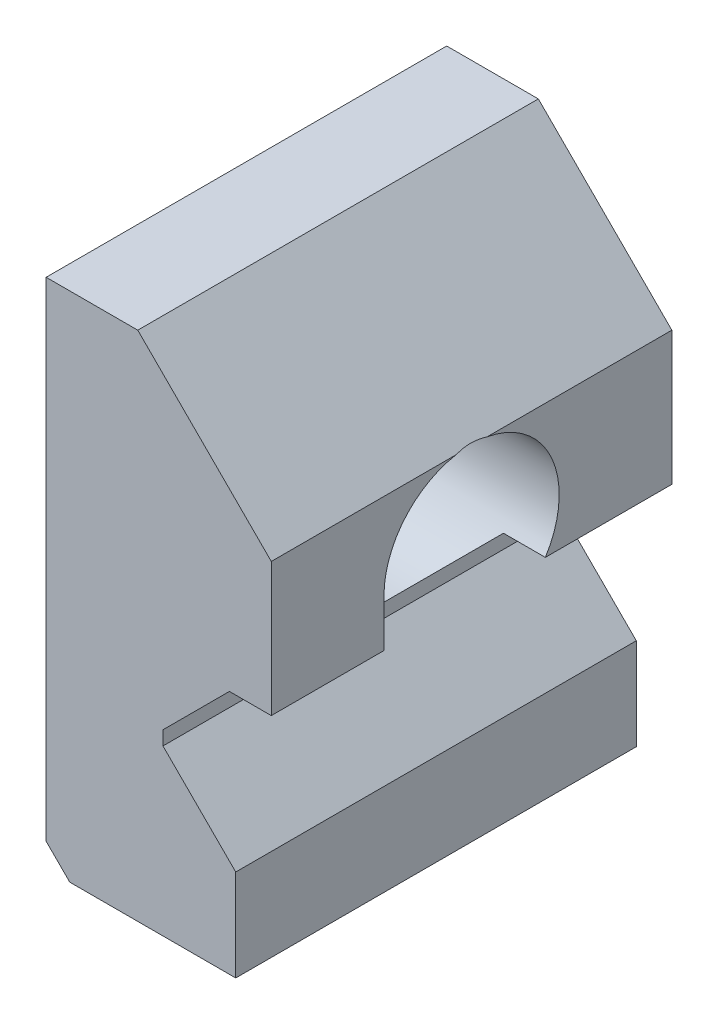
ISO-10303-21;
HEADER;
FILE_DESCRIPTION(('STEP AP214'),'2;1');
FILE_NAME('part.step','',(''),(''),'','','');
FILE_SCHEMA(('AUTOMOTIVE_DESIGN { 1 0 10303 214 1 1 1 1 }'));
ENDSEC;
DATA;
#1=APPLICATION_CONTEXT('core data for automotive mechanical design processes');
#2=APPLICATION_PROTOCOL_DEFINITION('international standard','automotive_design',2000,#1);
#3=PRODUCT_CONTEXT('',#1,'mechanical');
#4=PRODUCT('Part','Part','',(#3));
#5=PRODUCT_RELATED_PRODUCT_CATEGORY('part','',(#4));
#6=PRODUCT_DEFINITION_FORMATION('','',#4);
#7=PRODUCT_DEFINITION_CONTEXT('part definition',#1,'design');
#8=PRODUCT_DEFINITION('design','',#6,#7);
#9=PRODUCT_DEFINITION_SHAPE('','',#8);
#10=(LENGTH_UNIT() NAMED_UNIT(*) SI_UNIT(.MILLI.,.METRE.));
#11=(NAMED_UNIT(*) PLANE_ANGLE_UNIT() SI_UNIT($,.RADIAN.));
#12=(NAMED_UNIT(*) SI_UNIT($,.STERADIAN.) SOLID_ANGLE_UNIT());
#13=UNCERTAINTY_MEASURE_WITH_UNIT(LENGTH_MEASURE(1.E-05),#10,'distance_accuracy_value','');
#14=(GEOMETRIC_REPRESENTATION_CONTEXT(3) GLOBAL_UNCERTAINTY_ASSIGNED_CONTEXT((#13)) GLOBAL_UNIT_ASSIGNED_CONTEXT((#10,
#11,#12)) REPRESENTATION_CONTEXT('',''));
#15=CARTESIAN_POINT('',(0.,0.,0.));
#16=DIRECTION('',(0.,0.,1.));
#17=DIRECTION('',(1.,0.,0.));
#18=AXIS2_PLACEMENT_3D('',#15,#16,#17);
#19=CARTESIAN_POINT('',(-11.2395,4.59292261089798,7.62));
#20=DIRECTION('',(-1.,0.,0.));
#21=DIRECTION('',(0.,-1.,0.));
#22=AXIS2_PLACEMENT_3D('',#19,#20,#21);
#23=CYLINDRICAL_SURFACE('',#22,3.33375);
#24=CARTESIAN_POINT('',(-22.6695,4.59292261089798,7.62));
#25=DIRECTION('',(-1.,0.,0.));
#26=DIRECTION('',(0.,-1.,0.));
#27=AXIS2_PLACEMENT_3D('',#24,#25,#26);
#28=CIRCLE('',#27,3.33375);
#29=CARTESIAN_POINT('',(-22.6695,1.25917261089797,7.62));
#30=VERTEX_POINT('',#29);
#31=EDGE_CURVE('E65',#30,#30,#28,.F.);
#32=ORIENTED_EDGE('',*,*,#31,.F.);
#33=EDGE_LOOP('',(#32));
#34=FACE_BOUND('',#33,.T.);
#35=DIRECTION('',(1.,0.,0.));
#36=VECTOR('',#35,1.);
#37=CARTESIAN_POINT('',(-16.9672,4.59292261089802,10.95375));
#38=LINE('',#37,#36);
#39=CARTESIAN_POINT('',(-16.9672,4.59292261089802,10.95375));
#40=VERTEX_POINT('',#39);
#41=CARTESIAN_POINT('',(-15.37335,4.59292261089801,10.95375));
#42=VERTEX_POINT('',#41);
#43=EDGE_CURVE('E172',#40,#42,#38,.T.);
#44=ORIENTED_EDGE('',*,*,#43,.F.);
#45=CARTESIAN_POINT('',(-16.9672,4.59292261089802,7.62));
#46=DIRECTION('',(-1.,0.,0.));
#47=DIRECTION('',(0.,-1.,0.));
#48=AXIS2_PLACEMENT_3D('',#45,#46,#47);
#49=CIRCLE('',#48,3.33375);
#50=CARTESIAN_POINT('',(-16.9672,2.79400000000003,10.4267359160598));
#51=VERTEX_POINT('',#50);
#52=EDGE_CURVE('E179',#51,#40,#49,.T.);
#53=ORIENTED_EDGE('',*,*,#52,.F.);
#54=CARTESIAN_POINT('',(-15.168277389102,4.59292261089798,7.62));
#55=DIRECTION('',(-0.707106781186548,0.707106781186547,0.));
#56=DIRECTION('',(-0.707106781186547,-0.707106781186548,0.));
#57=AXIS2_PLACEMENT_3D('',#54,#55,#56);
#58=ELLIPSE('',#57,4.7146344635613,3.33375);
#59=CARTESIAN_POINT('',(-16.9672,2.79399999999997,4.81326408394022));
#60=VERTEX_POINT('',#59);
#61=EDGE_CURVE('E207',#60,#51,#58,.T.);
#62=ORIENTED_EDGE('',*,*,#61,.F.);
#63=DIRECTION('',(-1.,0.,0.));
#64=VECTOR('',#63,1.);
#65=CARTESIAN_POINT('',(-11.2395,2.79399999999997,4.81326408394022));
#66=LINE('',#65,#64);
#67=CARTESIAN_POINT('',(-15.37335,2.79399999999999,4.81326408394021));
#68=VERTEX_POINT('',#67);
#69=EDGE_CURVE('E86',#68,#60,#66,.T.);
#70=ORIENTED_EDGE('',*,*,#69,.F.);
#71=CARTESIAN_POINT('',(-15.37335,4.59292261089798,7.62));
#72=DIRECTION('',(-1.,0.,0.));
#73=DIRECTION('',(0.,-1.,0.));
#74=AXIS2_PLACEMENT_3D('',#71,#72,#73);
#75=CIRCLE('',#74,3.33375);
#76=CARTESIAN_POINT('',(-15.37335,7.874,7.0297286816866));
#77=VERTEX_POINT('',#76);
#78=EDGE_CURVE('E71',#77,#68,#75,.T.);
#79=ORIENTED_EDGE('',*,*,#78,.F.);
#80=CARTESIAN_POINT('',(-12.092272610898,4.59292261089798,7.62));
#81=DIRECTION('',(-0.707106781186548,-0.707106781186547,0.));
#82=DIRECTION('',(-0.707106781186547,0.707106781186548,0.));
#83=AXIS2_PLACEMENT_3D('',#80,#81,#82);
#84=ELLIPSE('',#83,4.71463446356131,3.33375);
#85=CARTESIAN_POINT('',(-15.37335,7.874,8.21027131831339));
#86=VERTEX_POINT('',#85);
#87=EDGE_CURVE('E210',#86,#77,#84,.T.);
#88=ORIENTED_EDGE('',*,*,#87,.F.);
#89=EDGE_CURVE('E12',#42,#86,#75,.T.);
#90=ORIENTED_EDGE('',*,*,#89,.F.);
#91=EDGE_LOOP('',(#44,#53,#62,#70,#79,#88,#90));
#92=FACE_BOUND('',#91,.T.);
#93=ADVANCED_FACE('F61',(#34,#92),#23,.F.);
#94=CARTESIAN_POINT('',(-16.9672,2.794,15.24));
#95=DIRECTION('',(0.,1.,0.));
#96=DIRECTION('',(-1.,0.,0.));
#97=AXIS2_PLACEMENT_3D('',#94,#95,#96);
#98=PLANE('',#97);
#99=DIRECTION('',(0.,0.,-1.));
#100=VECTOR('',#99,1.);
#101=CARTESIAN_POINT('',(-15.37335,2.79399999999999,15.24));
#102=LINE('',#101,#100);
#103=CARTESIAN_POINT('',(-15.37335,2.79399999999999,0.));
#104=VERTEX_POINT('',#103);
#105=EDGE_CURVE('E290',#68,#104,#102,.T.);
#106=ORIENTED_EDGE('',*,*,#105,.F.);
#107=ORIENTED_EDGE('',*,*,#69,.T.);
#108=DIRECTION('',(0.,0.,-1.));
#109=VECTOR('',#108,1.);
#110=CARTESIAN_POINT('',(-16.9672,2.794,15.24));
#111=LINE('',#110,#109);
#112=CARTESIAN_POINT('',(-16.9672,2.794,0.));
#113=VERTEX_POINT('',#112);
#114=EDGE_CURVE('E295',#60,#113,#111,.T.);
#115=ORIENTED_EDGE('',*,*,#114,.T.);
#116=DIRECTION('',(1.,0.,0.));
#117=VECTOR('',#116,1.);
#118=CARTESIAN_POINT('',(-16.9672,2.794,0.));
#119=LINE('',#118,#117);
#120=EDGE_CURVE('E279',#113,#104,#119,.T.);
#121=ORIENTED_EDGE('',*,*,#120,.T.);
#122=EDGE_LOOP('',(#106,#107,#115,#121));
#123=FACE_BOUND('',#122,.T.);
#124=ADVANCED_FACE('F337',(#123),#98,.F.);
#125=CARTESIAN_POINT('',(-15.37335,2.79399999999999,15.24));
#126=DIRECTION('',(-1.,0.,0.));
#127=DIRECTION('',(0.,-1.,0.));
#128=AXIS2_PLACEMENT_3D('',#125,#126,#127);
#129=PLANE('',#128);
#130=CARTESIAN_POINT('',(-15.37335,2.79399999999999,15.24));
#131=VERTEX_POINT('',#130);
#132=CARTESIAN_POINT('',(-15.37335,2.79400000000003,10.95375));
#133=VERTEX_POINT('',#132);
#134=EDGE_CURVE('E291',#131,#133,#102,.T.);
#135=ORIENTED_EDGE('',*,*,#134,.T.);
#136=DIRECTION('',(0.,-1.,0.));
#137=VECTOR('',#136,1.);
#138=CARTESIAN_POINT('',(-15.37335,4.59292261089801,10.95375));
#139=LINE('',#138,#137);
#140=EDGE_CURVE('E185',#42,#133,#139,.T.);
#141=ORIENTED_EDGE('',*,*,#140,.F.);
#142=ORIENTED_EDGE('',*,*,#89,.T.);
#143=DIRECTION('',(0.,0.,-1.));
#144=VECTOR('',#143,1.);
#145=CARTESIAN_POINT('',(-15.37335,7.874,15.24));
#146=LINE('',#145,#144);
#147=CARTESIAN_POINT('',(-15.37335,7.874,15.24));
#148=VERTEX_POINT('',#147);
#149=EDGE_CURVE('E286',#148,#86,#146,.T.);
#150=ORIENTED_EDGE('',*,*,#149,.F.);
#151=DIRECTION('',(0.,1.,0.));
#152=VECTOR('',#151,1.);
#153=CARTESIAN_POINT('',(-15.37335,2.79399999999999,15.24));
#154=LINE('',#153,#152);
#155=EDGE_CURVE('E247',#131,#148,#154,.T.);
#156=ORIENTED_EDGE('',*,*,#155,.F.);
#157=EDGE_LOOP('',(#135,#141,#142,#150,#156));
#158=FACE_BOUND('',#157,.T.);
#159=ADVANCED_FACE('F355',(#158),#129,.F.);
#160=CARTESIAN_POINT('',(-15.37335,7.874,15.24));
#161=DIRECTION('',(-0.707106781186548,-0.707106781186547,0.));
#162=DIRECTION('',(0.707106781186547,-0.707106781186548,0.));
#163=AXIS2_PLACEMENT_3D('',#160,#161,#162);
#164=PLANE('',#163);
#165=ORIENTED_EDGE('',*,*,#149,.T.);
#166=ORIENTED_EDGE('',*,*,#87,.T.);
#167=CARTESIAN_POINT('',(-15.37335,7.874,0.));
#168=VERTEX_POINT('',#167);
#169=EDGE_CURVE('E250',#77,#168,#146,.T.);
#170=ORIENTED_EDGE('',*,*,#169,.T.);
#171=DIRECTION('',(-0.707106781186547,0.707106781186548,0.));
#172=VECTOR('',#171,1.);
#173=CARTESIAN_POINT('',(-15.37335,7.874,0.));
#174=LINE('',#173,#172);
#175=CARTESIAN_POINT('',(-20.45335,12.954,0.));
#176=VERTEX_POINT('',#175);
#177=EDGE_CURVE('E214',#168,#176,#174,.T.);
#178=ORIENTED_EDGE('',*,*,#177,.T.);
#179=DIRECTION('',(0.,0.,-1.));
#180=VECTOR('',#179,1.);
#181=CARTESIAN_POINT('',(-20.45335,12.954,15.24));
#182=LINE('',#181,#180);
#183=CARTESIAN_POINT('',(-20.45335,12.954,15.24));
#184=VERTEX_POINT('',#183);
#185=EDGE_CURVE('E328',#184,#176,#182,.T.);
#186=ORIENTED_EDGE('',*,*,#185,.F.);
#187=DIRECTION('',(-0.707106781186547,0.707106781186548,0.));
#188=VECTOR('',#187,1.);
#189=CARTESIAN_POINT('',(-15.37335,7.874,15.24));
#190=LINE('',#189,#188);
#191=EDGE_CURVE('E215',#148,#184,#190,.T.);
#192=ORIENTED_EDGE('',*,*,#191,.F.);
#193=EDGE_LOOP('',(#165,#166,#170,#178,#186,#192));
#194=FACE_BOUND('',#193,.T.);
#195=ADVANCED_FACE('F63',(#194),#164,.F.);
#196=CARTESIAN_POINT('',(-20.45335,12.954,15.24));
#197=DIRECTION('',(0.,-1.,0.));
#198=DIRECTION('',(1.,0.,0.));
#199=AXIS2_PLACEMENT_3D('',#196,#197,#198);
#200=PLANE('',#199);
#201=DIRECTION('',(-1.,0.,0.));
#202=VECTOR('',#201,1.);
#203=CARTESIAN_POINT('',(-20.45335,12.954,0.));
#204=LINE('',#203,#202);
#205=CARTESIAN_POINT('',(-23.9395,12.954,0.));
#206=VERTEX_POINT('',#205);
#207=EDGE_CURVE('E254',#176,#206,#204,.T.);
#208=ORIENTED_EDGE('',*,*,#207,.T.);
#209=DIRECTION('',(0.,0.,-1.));
#210=VECTOR('',#209,1.);
#211=CARTESIAN_POINT('',(-23.9395,12.954,15.24));
#212=LINE('',#211,#210);
#213=CARTESIAN_POINT('',(-23.9395,12.954,15.24));
#214=VERTEX_POINT('',#213);
#215=EDGE_CURVE('E324',#214,#206,#212,.T.);
#216=ORIENTED_EDGE('',*,*,#215,.F.);
#217=DIRECTION('',(-1.,0.,0.));
#218=VECTOR('',#217,1.);
#219=CARTESIAN_POINT('',(-20.45335,12.954,15.24));
#220=LINE('',#219,#218);
#221=EDGE_CURVE('E219',#184,#214,#220,.T.);
#222=ORIENTED_EDGE('',*,*,#221,.F.);
#223=ORIENTED_EDGE('',*,*,#185,.T.);
#224=EDGE_LOOP('',(#208,#216,#222,#223));
#225=FACE_BOUND('',#224,.T.);
#226=ADVANCED_FACE('F400',(#225),#200,.F.);
#227=CARTESIAN_POINT('',(-23.9395,12.954,15.24));
#228=DIRECTION('',(1.,0.,0.));
#229=DIRECTION('',(0.,0.,-1.));
#230=AXIS2_PLACEMENT_3D('',#227,#228,#229);
#231=PLANE('',#230);
#232=CARTESIAN_POINT('',(-23.9395,4.59292261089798,7.62));
#233=DIRECTION('',(-1.,0.,0.));
#234=DIRECTION('',(0.,-1.,0.));
#235=AXIS2_PLACEMENT_3D('',#232,#233,#234);
#236=CIRCLE('',#235,6.50875);
#237=CARTESIAN_POINT('',(-23.9395,-1.91582738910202,7.62));
#238=VERTEX_POINT('',#237);
#239=EDGE_CURVE('E193',#238,#238,#236,.T.);
#240=ORIENTED_EDGE('',*,*,#239,.F.);
#241=EDGE_LOOP('',(#240));
#242=FACE_BOUND('',#241,.T.);
#243=DIRECTION('',(0.,-1.,0.));
#244=VECTOR('',#243,1.);
#245=CARTESIAN_POINT('',(-23.9395,12.954,0.));
#246=LINE('',#245,#244);
#247=CARTESIAN_POINT('',(-23.9395,-5.62977438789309,0.));
#248=VERTEX_POINT('',#247);
#249=EDGE_CURVE('E257',#206,#248,#246,.T.);
#250=ORIENTED_EDGE('',*,*,#249,.T.);
#251=DIRECTION('',(0.,0.,-1.));
#252=VECTOR('',#251,1.);
#253=CARTESIAN_POINT('',(-23.9395,-5.62977438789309,15.24));
#254=LINE('',#253,#252);
#255=CARTESIAN_POINT('',(-23.9395,-5.62977438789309,15.24));
#256=VERTEX_POINT('',#255);
#257=EDGE_CURVE('E320',#256,#248,#254,.T.);
#258=ORIENTED_EDGE('',*,*,#257,.F.);
#259=DIRECTION('',(0.,-1.,0.));
#260=VECTOR('',#259,1.);
#261=CARTESIAN_POINT('',(-23.9395,12.954,15.24));
#262=LINE('',#261,#260);
#263=EDGE_CURVE('E223',#214,#256,#262,.T.);
#264=ORIENTED_EDGE('',*,*,#263,.F.);
#265=ORIENTED_EDGE('',*,*,#215,.T.);
#266=EDGE_LOOP('',(#250,#258,#264,#265));
#267=FACE_BOUND('',#266,.T.);
#268=ADVANCED_FACE('F397',(#242,#267),#231,.F.);
#269=CARTESIAN_POINT('',(-23.9395,-5.62977438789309,15.24));
#270=DIRECTION('',(0.707106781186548,0.707106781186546,0.));
#271=DIRECTION('',(-0.707106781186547,0.707106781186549,0.));
#272=AXIS2_PLACEMENT_3D('',#269,#270,#271);
#273=PLANE('',#272);
#274=DIRECTION('',(0.707106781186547,-0.707106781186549,0.));
#275=VECTOR('',#274,1.);
#276=CARTESIAN_POINT('',(-23.9395,-5.62977438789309,0.));
#277=LINE('',#276,#275);
#278=CARTESIAN_POINT('',(-23.0414743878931,-6.52780000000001,0.));
#279=VERTEX_POINT('',#278);
#280=EDGE_CURVE('E260',#248,#279,#277,.T.);
#281=ORIENTED_EDGE('',*,*,#280,.T.);
#282=DIRECTION('',(0.,0.,-1.));
#283=VECTOR('',#282,1.);
#284=CARTESIAN_POINT('',(-23.0414743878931,-6.52780000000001,15.24));
#285=LINE('',#284,#283);
#286=CARTESIAN_POINT('',(-23.0414743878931,-6.52780000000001,15.24));
#287=VERTEX_POINT('',#286);
#288=EDGE_CURVE('E316',#287,#279,#285,.T.);
#289=ORIENTED_EDGE('',*,*,#288,.F.);
#290=DIRECTION('',(0.707106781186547,-0.707106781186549,0.));
#291=VECTOR('',#290,1.);
#292=CARTESIAN_POINT('',(-23.9395,-5.62977438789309,15.24));
#293=LINE('',#292,#291);
#294=EDGE_CURVE('E226',#256,#287,#293,.T.);
#295=ORIENTED_EDGE('',*,*,#294,.F.);
#296=ORIENTED_EDGE('',*,*,#257,.T.);
#297=EDGE_LOOP('',(#281,#289,#295,#296));
#298=FACE_BOUND('',#297,.T.);
#299=ADVANCED_FACE('F393',(#298),#273,.F.);
#300=CARTESIAN_POINT('',(-23.0414743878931,-6.52780000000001,15.24));
#301=DIRECTION('',(0.,1.,0.));
#302=DIRECTION('',(-1.,0.,0.));
#303=AXIS2_PLACEMENT_3D('',#300,#301,#302);
#304=PLANE('',#303);
#305=DIRECTION('',(1.,0.,0.));
#306=VECTOR('',#305,1.);
#307=CARTESIAN_POINT('',(-23.0414743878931,-6.52780000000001,0.));
#308=LINE('',#307,#306);
#309=CARTESIAN_POINT('',(-16.7259,-6.52780000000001,0.));
#310=VERTEX_POINT('',#309);
#311=EDGE_CURVE('E263',#279,#310,#308,.T.);
#312=ORIENTED_EDGE('',*,*,#311,.T.);
#313=DIRECTION('',(0.,0.,-1.));
#314=VECTOR('',#313,1.);
#315=CARTESIAN_POINT('',(-16.7259,-6.52780000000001,15.24));
#316=LINE('',#315,#314);
#317=CARTESIAN_POINT('',(-16.7259,-6.52780000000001,15.24));
#318=VERTEX_POINT('',#317);
#319=EDGE_CURVE('E312',#318,#310,#316,.T.);
#320=ORIENTED_EDGE('',*,*,#319,.F.);
#321=DIRECTION('',(1.,0.,0.));
#322=VECTOR('',#321,1.);
#323=CARTESIAN_POINT('',(-23.0414743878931,-6.52780000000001,15.24));
#324=LINE('',#323,#322);
#325=EDGE_CURVE('E229',#287,#318,#324,.T.);
#326=ORIENTED_EDGE('',*,*,#325,.F.);
#327=ORIENTED_EDGE('',*,*,#288,.T.);
#328=EDGE_LOOP('',(#312,#320,#326,#327));
#329=FACE_BOUND('',#328,.T.);
#330=ADVANCED_FACE('F389',(#329),#304,.F.);
#331=CARTESIAN_POINT('',(-16.7259,-6.52780000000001,15.24));
#332=DIRECTION('',(-1.,0.,0.));
#333=DIRECTION('',(0.,0.,1.));
#334=AXIS2_PLACEMENT_3D('',#331,#332,#333);
#335=PLANE('',#334);
#336=DIRECTION('',(0.,1.,0.));
#337=VECTOR('',#336,1.);
#338=CARTESIAN_POINT('',(-16.7259,-6.52780000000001,0.));
#339=LINE('',#338,#337);
#340=CARTESIAN_POINT('',(-16.7259,-3.03530000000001,0.));
#341=VERTEX_POINT('',#340);
#342=EDGE_CURVE('E266',#310,#341,#339,.T.);
#343=ORIENTED_EDGE('',*,*,#342,.T.);
#344=DIRECTION('',(0.,0.,-1.));
#345=VECTOR('',#344,1.);
#346=CARTESIAN_POINT('',(-16.7259,-3.03530000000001,15.24));
#347=LINE('',#346,#345);
#348=CARTESIAN_POINT('',(-16.7259,-3.03530000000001,15.24));
#349=VERTEX_POINT('',#348);
#350=EDGE_CURVE('E308',#349,#341,#347,.T.);
#351=ORIENTED_EDGE('',*,*,#350,.F.);
#352=DIRECTION('',(0.,1.,0.));
#353=VECTOR('',#352,1.);
#354=CARTESIAN_POINT('',(-16.7259,-6.52780000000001,15.24));
#355=LINE('',#354,#353);
#356=EDGE_CURVE('E232',#318,#349,#355,.T.);
#357=ORIENTED_EDGE('',*,*,#356,.F.);
#358=ORIENTED_EDGE('',*,*,#319,.T.);
#359=EDGE_LOOP('',(#343,#351,#357,#358));
#360=FACE_BOUND('',#359,.T.);
#361=ADVANCED_FACE('F385',(#360),#335,.F.);
#362=CARTESIAN_POINT('',(-16.7259,-3.03530000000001,15.24));
#363=DIRECTION('',(-0.707106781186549,-0.707106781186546,0.));
#364=DIRECTION('',(0.707106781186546,-0.707106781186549,0.));
#365=AXIS2_PLACEMENT_3D('',#362,#363,#364);
#366=PLANE('',#365);
#367=DIRECTION('',(-0.707106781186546,0.707106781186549,0.));
#368=VECTOR('',#367,1.);
#369=CARTESIAN_POINT('',(-16.7259,-3.03530000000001,0.));
#370=LINE('',#369,#368);
#371=CARTESIAN_POINT('',(-19.4945,-0.266700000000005,0.));
#372=VERTEX_POINT('',#371);
#373=EDGE_CURVE('E269',#341,#372,#370,.T.);
#374=ORIENTED_EDGE('',*,*,#373,.T.);
#375=DIRECTION('',(0.,0.,-1.));
#376=VECTOR('',#375,1.);
#377=CARTESIAN_POINT('',(-19.4945,-0.266700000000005,15.24));
#378=LINE('',#377,#376);
#379=CARTESIAN_POINT('',(-19.4945,-0.266700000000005,15.24));
#380=VERTEX_POINT('',#379);
#381=EDGE_CURVE('E304',#380,#372,#378,.T.);
#382=ORIENTED_EDGE('',*,*,#381,.F.);
#383=DIRECTION('',(-0.707106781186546,0.707106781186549,0.));
#384=VECTOR('',#383,1.);
#385=CARTESIAN_POINT('',(-16.7259,-3.03530000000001,15.24));
#386=LINE('',#385,#384);
#387=EDGE_CURVE('E235',#349,#380,#386,.T.);
#388=ORIENTED_EDGE('',*,*,#387,.F.);
#389=ORIENTED_EDGE('',*,*,#350,.T.);
#390=EDGE_LOOP('',(#374,#382,#388,#389));
#391=FACE_BOUND('',#390,.T.);
#392=ADVANCED_FACE('F381',(#391),#366,.F.);
#393=CARTESIAN_POINT('',(-19.4945,-0.266700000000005,15.24));
#394=DIRECTION('',(-1.,0.,0.));
#395=DIRECTION('',(0.,-1.,0.));
#396=AXIS2_PLACEMENT_3D('',#393,#394,#395);
#397=PLANE('',#396);
#398=DIRECTION('',(0.,1.,0.));
#399=VECTOR('',#398,1.);
#400=CARTESIAN_POINT('',(-19.4945,-0.266700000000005,0.));
#401=LINE('',#400,#399);
#402=CARTESIAN_POINT('',(-19.4945,0.26669999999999,0.));
#403=VERTEX_POINT('',#402);
#404=EDGE_CURVE('E272',#372,#403,#401,.T.);
#405=ORIENTED_EDGE('',*,*,#404,.T.);
#406=DIRECTION('',(0.,0.,-1.));
#407=VECTOR('',#406,1.);
#408=CARTESIAN_POINT('',(-19.4945,0.26669999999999,15.24));
#409=LINE('',#408,#407);
#410=CARTESIAN_POINT('',(-19.4945,0.26669999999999,15.24));
#411=VERTEX_POINT('',#410);
#412=EDGE_CURVE('E300',#411,#403,#409,.T.);
#413=ORIENTED_EDGE('',*,*,#412,.F.);
#414=DIRECTION('',(0.,1.,0.));
#415=VECTOR('',#414,1.);
#416=CARTESIAN_POINT('',(-19.4945,-0.266700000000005,15.24));
#417=LINE('',#416,#415);
#418=EDGE_CURVE('E238',#380,#411,#417,.T.);
#419=ORIENTED_EDGE('',*,*,#418,.F.);
#420=ORIENTED_EDGE('',*,*,#381,.T.);
#421=EDGE_LOOP('',(#405,#413,#419,#420));
#422=FACE_BOUND('',#421,.T.);
#423=ADVANCED_FACE('F377',(#422),#397,.F.);
#424=CARTESIAN_POINT('',(-19.4945,0.26669999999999,15.24));
#425=DIRECTION('',(-0.707106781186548,0.707106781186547,0.));
#426=DIRECTION('',(-0.707106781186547,-0.707106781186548,0.));
#427=AXIS2_PLACEMENT_3D('',#424,#425,#426);
#428=PLANE('',#427);
#429=ORIENTED_EDGE('',*,*,#114,.F.);
#430=ORIENTED_EDGE('',*,*,#61,.T.);
#431=DIRECTION('',(0.,0.,-1.));
#432=VECTOR('',#431,1.);
#433=CARTESIAN_POINT('',(-16.9672,2.79400000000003,10.95375));
#434=LINE('',#433,#432);
#435=CARTESIAN_POINT('',(-16.9672,2.794,10.95375));
#436=VERTEX_POINT('',#435);
#437=EDGE_CURVE('E178',#436,#51,#434,.T.);
#438=ORIENTED_EDGE('',*,*,#437,.F.);
#439=CARTESIAN_POINT('',(-16.9672,2.794,15.24));
#440=VERTEX_POINT('',#439);
#441=EDGE_CURVE('E296',#440,#436,#111,.T.);
#442=ORIENTED_EDGE('',*,*,#441,.F.);
#443=DIRECTION('',(0.707106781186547,0.707106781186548,0.));
#444=VECTOR('',#443,1.);
#445=CARTESIAN_POINT('',(-19.4945,0.26669999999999,15.24));
#446=LINE('',#445,#444);
#447=EDGE_CURVE('E241',#411,#440,#446,.T.);
#448=ORIENTED_EDGE('',*,*,#447,.F.);
#449=ORIENTED_EDGE('',*,*,#412,.T.);
#450=DIRECTION('',(0.707106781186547,0.707106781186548,0.));
#451=VECTOR('',#450,1.);
#452=CARTESIAN_POINT('',(-19.4945,0.26669999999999,0.));
#453=LINE('',#452,#451);
#454=EDGE_CURVE('E275',#403,#113,#453,.T.);
#455=ORIENTED_EDGE('',*,*,#454,.T.);
#456=EDGE_LOOP('',(#429,#430,#438,#442,#448,#449,#455));
#457=FACE_BOUND('',#456,.T.);
#458=ADVANCED_FACE('F373',(#457),#428,.F.);
#459=ORIENTED_EDGE('',*,*,#441,.T.);
#460=DIRECTION('',(1.,0.,0.));
#461=VECTOR('',#460,1.);
#462=CARTESIAN_POINT('',(-16.9672,2.79400000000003,10.95375));
#463=LINE('',#462,#461);
#464=EDGE_CURVE('E175',#436,#133,#463,.T.);
#465=ORIENTED_EDGE('',*,*,#464,.T.);
#466=ORIENTED_EDGE('',*,*,#134,.F.);
#467=DIRECTION('',(1.,0.,0.));
#468=VECTOR('',#467,1.);
#469=CARTESIAN_POINT('',(-16.9672,2.794,15.24));
#470=LINE('',#469,#468);
#471=EDGE_CURVE('E244',#440,#131,#470,.T.);
#472=ORIENTED_EDGE('',*,*,#471,.F.);
#473=EDGE_LOOP('',(#459,#465,#466,#472));
#474=FACE_BOUND('',#473,.T.);
#475=ADVANCED_FACE('F357',(#474),#98,.F.);
#476=ORIENTED_EDGE('',*,*,#169,.F.);
#477=ORIENTED_EDGE('',*,*,#78,.T.);
#478=ORIENTED_EDGE('',*,*,#105,.T.);
#479=DIRECTION('',(0.,1.,0.));
#480=VECTOR('',#479,1.);
#481=CARTESIAN_POINT('',(-15.37335,2.79399999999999,0.));
#482=LINE('',#481,#480);
#483=EDGE_CURVE('E220',#104,#168,#482,.T.);
#484=ORIENTED_EDGE('',*,*,#483,.T.);
#485=EDGE_LOOP('',(#476,#477,#478,#484));
#486=FACE_BOUND('',#485,.T.);
#487=ADVANCED_FACE('F335',(#486),#129,.F.);
#488=CARTESIAN_POINT('',(0.,0.,15.24));
#489=DIRECTION('',(0.,0.,-1.));
#490=DIRECTION('',(-1.,0.,0.));
#491=AXIS2_PLACEMENT_3D('',#488,#489,#490);
#492=PLANE('',#491);
#493=ORIENTED_EDGE('',*,*,#191,.T.);
#494=ORIENTED_EDGE('',*,*,#221,.T.);
#495=ORIENTED_EDGE('',*,*,#263,.T.);
#496=ORIENTED_EDGE('',*,*,#294,.T.);
#497=ORIENTED_EDGE('',*,*,#325,.T.);
#498=ORIENTED_EDGE('',*,*,#356,.T.);
#499=ORIENTED_EDGE('',*,*,#387,.T.);
#500=ORIENTED_EDGE('',*,*,#418,.T.);
#501=ORIENTED_EDGE('',*,*,#447,.T.);
#502=ORIENTED_EDGE('',*,*,#471,.T.);
#503=ORIENTED_EDGE('',*,*,#155,.T.);
#504=EDGE_LOOP('',(#493,#494,#495,#496,#497,#498,#499,#500,#501,#502,#503));
#505=FACE_BOUND('',#504,.T.);
#506=ADVANCED_FACE('F362',(#505),#492,.F.);
#507=CARTESIAN_POINT('',(0.,0.,0.));
#508=DIRECTION('',(0.,0.,-1.));
#509=DIRECTION('',(-1.,0.,0.));
#510=AXIS2_PLACEMENT_3D('',#507,#508,#509);
#511=PLANE('',#510);
#512=ORIENTED_EDGE('',*,*,#177,.F.);
#513=ORIENTED_EDGE('',*,*,#483,.F.);
#514=ORIENTED_EDGE('',*,*,#120,.F.);
#515=ORIENTED_EDGE('',*,*,#454,.F.);
#516=ORIENTED_EDGE('',*,*,#404,.F.);
#517=ORIENTED_EDGE('',*,*,#373,.F.);
#518=ORIENTED_EDGE('',*,*,#342,.F.);
#519=ORIENTED_EDGE('',*,*,#311,.F.);
#520=ORIENTED_EDGE('',*,*,#280,.F.);
#521=ORIENTED_EDGE('',*,*,#249,.F.);
#522=ORIENTED_EDGE('',*,*,#207,.F.);
#523=EDGE_LOOP('',(#512,#513,#514,#515,#516,#517,#518,#519,#520,#521,#522));
#524=FACE_BOUND('',#523,.T.);
#525=ADVANCED_FACE('F365',(#524),#511,.T.);
#526=CARTESIAN_POINT('',(-22.6695,4.59292261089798,7.62));
#527=DIRECTION('',(-1.,0.,0.));
#528=DIRECTION('',(0.,-1.,0.));
#529=AXIS2_PLACEMENT_3D('',#526,#527,#528);
#530=PLANE('',#529);
#531=CARTESIAN_POINT('',(-22.6695,4.59292261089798,7.62));
#532=DIRECTION('',(-1.,0.,0.));
#533=DIRECTION('',(0.,-1.,0.));
#534=AXIS2_PLACEMENT_3D('',#531,#532,#533);
#535=CIRCLE('',#534,6.50875);
#536=CARTESIAN_POINT('',(-22.6695,-1.91582738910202,7.62));
#537=VERTEX_POINT('',#536);
#538=EDGE_CURVE('E198',#537,#537,#535,.T.);
#539=ORIENTED_EDGE('',*,*,#538,.T.);
#540=EDGE_LOOP('',(#539));
#541=FACE_BOUND('',#540,.T.);
#542=ORIENTED_EDGE('',*,*,#31,.T.);
#543=EDGE_LOOP('',(#542));
#544=FACE_BOUND('',#543,.T.);
#545=ADVANCED_FACE('F348',(#541,#544),#530,.T.);
#546=CARTESIAN_POINT('',(-22.6695,4.59292261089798,7.62));
#547=DIRECTION('',(-1.,0.,0.));
#548=DIRECTION('',(0.,-1.,0.));
#549=AXIS2_PLACEMENT_3D('',#546,#547,#548);
#550=CYLINDRICAL_SURFACE('',#549,6.50875);
#551=ORIENTED_EDGE('',*,*,#538,.F.);
#552=EDGE_LOOP('',(#551));
#553=FACE_BOUND('',#552,.T.);
#554=ORIENTED_EDGE('',*,*,#239,.T.);
#555=EDGE_LOOP('',(#554));
#556=FACE_BOUND('',#555,.T.);
#557=ADVANCED_FACE('F360',(#553,#556),#550,.F.);
#558=CARTESIAN_POINT('',(-16.9672,4.59292261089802,10.95375));
#559=DIRECTION('',(0.,0.,1.));
#560=DIRECTION('',(1.,0.,0.));
#561=AXIS2_PLACEMENT_3D('',#558,#559,#560);
#562=PLANE('',#561);
#563=ORIENTED_EDGE('',*,*,#140,.T.);
#564=ORIENTED_EDGE('',*,*,#464,.F.);
#565=DIRECTION('',(0.,-1.,0.));
#566=VECTOR('',#565,1.);
#567=CARTESIAN_POINT('',(-16.9672,4.59292261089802,10.95375));
#568=LINE('',#567,#566);
#569=EDGE_CURVE('E78',#40,#436,#568,.T.);
#570=ORIENTED_EDGE('',*,*,#569,.F.);
#571=ORIENTED_EDGE('',*,*,#43,.T.);
#572=EDGE_LOOP('',(#563,#564,#570,#571));
#573=FACE_BOUND('',#572,.T.);
#574=ADVANCED_FACE('F170',(#573),#562,.F.);
#575=CARTESIAN_POINT('',(-16.9672,4.59292261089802,7.62));
#576=DIRECTION('',(-1.,0.,0.));
#577=DIRECTION('',(0.,-1.,0.));
#578=AXIS2_PLACEMENT_3D('',#575,#576,#577);
#579=PLANE('',#578);
#580=ORIENTED_EDGE('',*,*,#52,.T.);
#581=ORIENTED_EDGE('',*,*,#569,.T.);
#582=ORIENTED_EDGE('',*,*,#437,.T.);
#583=EDGE_LOOP('',(#580,#581,#582));
#584=FACE_BOUND('',#583,.T.);
#585=ADVANCED_FACE('F182',(#584),#579,.F.);
#586=CLOSED_SHELL('',(#93,#124,#159,#195,#226,#268,#299,#330,#361,#392,#423,#458,#475,#487,#506,
#525,#545,#557,#574,#585));
#587=MANIFOLD_SOLID_BREP('B2',#586);
#588=ADVANCED_BREP_SHAPE_REPRESENTATION('',(#18,#587),#14);
#589=SHAPE_DEFINITION_REPRESENTATION(#9,#588);
ENDSEC;
END-ISO-10303-21;
